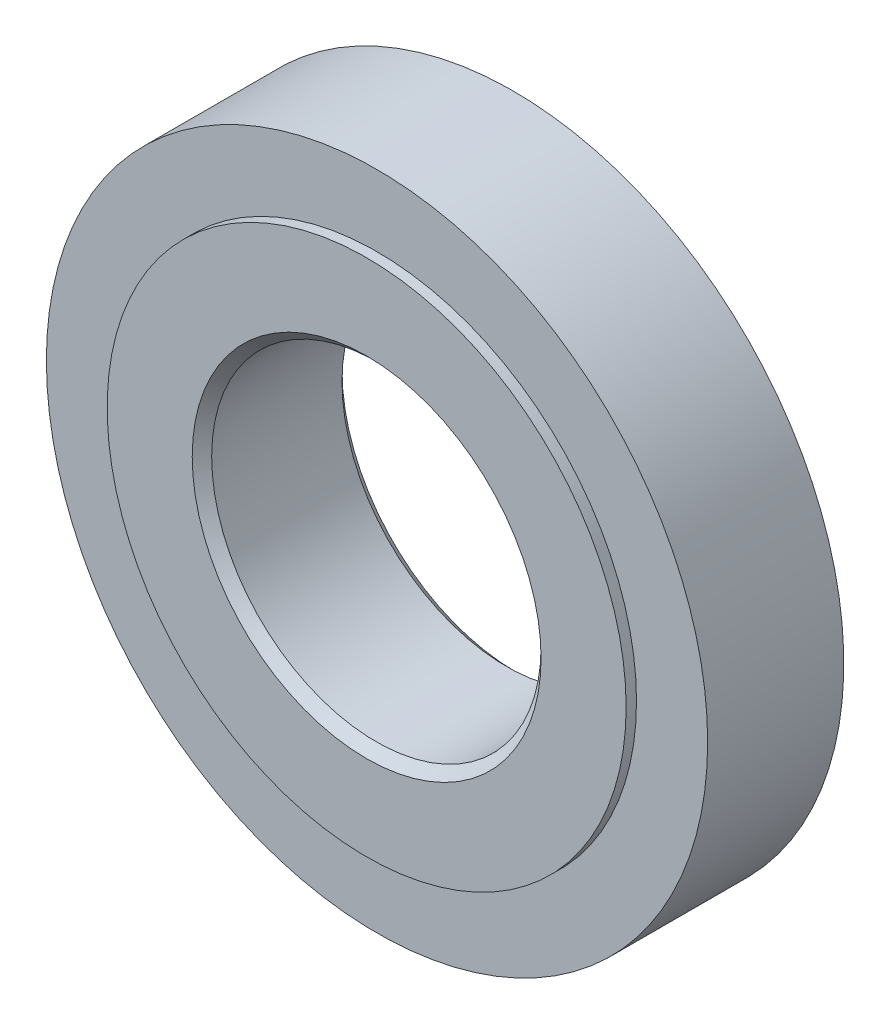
from build123d import *

# Parameters (mm, degrees)
SKETCH1_R                 = 51
EXTRUDE1_DEPTH            = 11.55
SKETCH2_R                 = 51
SKETCH2_R_2               = 40.025
CUT_EXTRUDE1_DEPTH        = 1.6
CUT_EXTRUDE2_START        = -0.5
SKETCH3_R                 = 51
SKETCH3_R_2               = 40.025
CUT_EXTRUDE2_DEPTH        = 0.5
SKETCH4_R                 = 25.405
CUT_EXTRUDE3_DEPTH        = 76.733810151
M5X0_8_TAPPED_HOLE1_D     = 4.2
M5X0_8_TAPPED_HOLE1_DEPTH = 12.7
M5X0_8_TAPPED_HOLE1_TIP   = 1.2618073
CHAMFER1_SIZE             = 1.5


with BuildPart() as part:
    # Sketch1 → Extrude1 (new, symmetric)
    with BuildSketch(Plane.XY):
        Circle(SKETCH1_R)
    extrude(amount=EXTRUDE1_DEPTH, both=True)

    # Sketch2 → Cut-Extrude1 (cut)
    with BuildSketch(Plane.XY.offset(11.55)):
        Circle(SKETCH2_R)
        Circle(SKETCH2_R_2, mode=Mode.SUBTRACT)
    extrude(amount=-CUT_EXTRUDE1_DEPTH, mode=Mode.SUBTRACT)

    # Sketch3 → Cut-Extrude2 (cut)
    with BuildSketch(Plane(origin=(0, 0, -11.55), x_dir=(-1, 0, 0), z_dir=(0, 0, -1)).offset(CUT_EXTRUDE2_START)):
        Circle(SKETCH3_R)
        with Locations(Location((0, 0, 0), (0, 0, 180))):
            Circle(SKETCH3_R_2, mode=Mode.SUBTRACT)
    extrude(amount=CUT_EXTRUDE2_DEPTH, mode=Mode.SUBTRACT)

    # Sketch4 → Cut-Extrude3 (cut, through all)
    with BuildSketch(Plane.XY.offset(11.55)):
        Circle(SKETCH4_R)
    extrude(amount=-CUT_EXTRUDE3_DEPTH, mode=Mode.SUBTRACT)

    # M5x0.8 Tapped Hole1
    with Locations(Plane(origin=(0, 32, -11.55), x_dir=(-1, 0, 0), z_dir=(0, 0, -1))):
        with Locations((0, 0), (32, -32), (-32, -32), (0, -64)):
            Hole(M5X0_8_TAPPED_HOLE1_D / 2, depth=M5X0_8_TAPPED_HOLE1_DEPTH)
            with Locations((0, 0, -(M5X0_8_TAPPED_HOLE1_DEPTH + M5X0_8_TAPPED_HOLE1_TIP / 2))):  # 118° drill point
                Cone(0, M5X0_8_TAPPED_HOLE1_D / 2, M5X0_8_TAPPED_HOLE1_TIP, mode=Mode.SUBTRACT)

    # Chamfer1
    chamfer1_edges = [part.edges().sort_by_distance(p)[0] for p in [
        (-25.405, 0, -11.55),
        (-25.405, 0, 11.55),
    ]]
    chamfer(chamfer1_edges, length=CHAMFER1_SIZE)


solid = part.part
